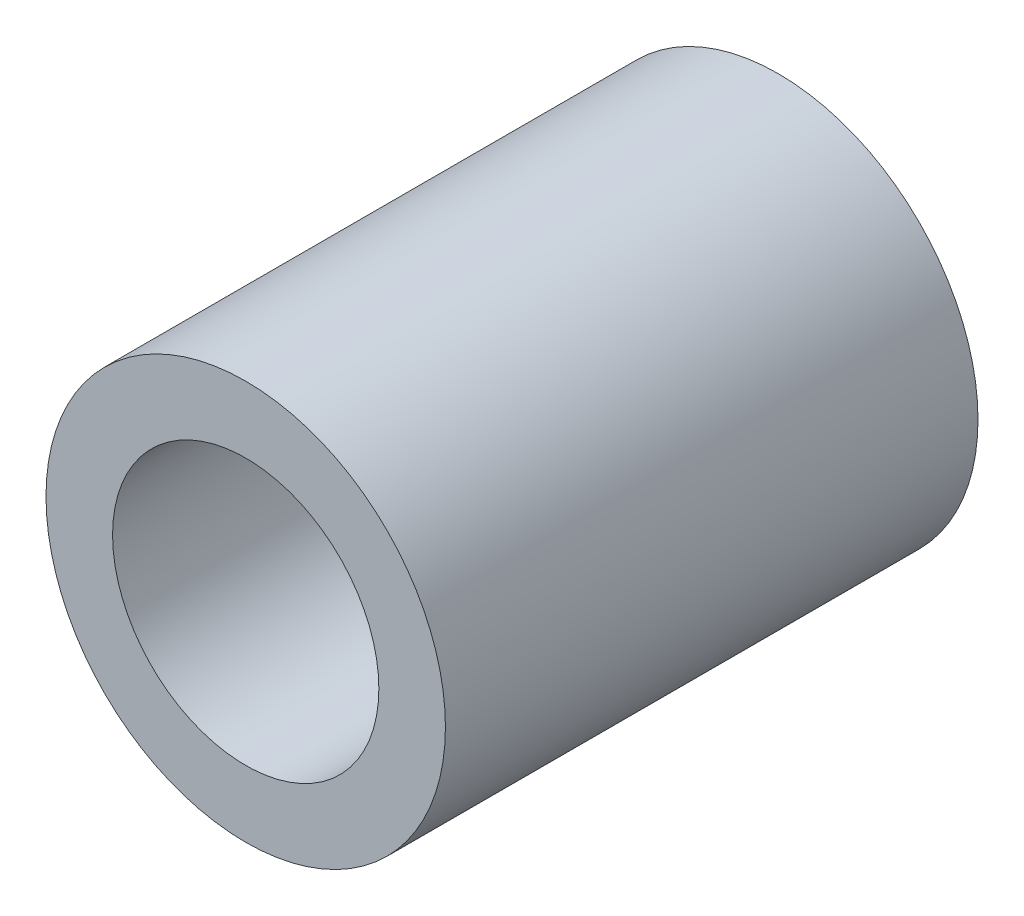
ISO-10303-21;
HEADER;
FILE_DESCRIPTION(('STEP AP214'),'2;1');
FILE_NAME('part.step','',(''),(''),'','','');
FILE_SCHEMA(('AUTOMOTIVE_DESIGN { 1 0 10303 214 1 1 1 1 }'));
ENDSEC;
DATA;
#1=APPLICATION_CONTEXT('core data for automotive mechanical design processes');
#2=APPLICATION_PROTOCOL_DEFINITION('international standard','automotive_design',2000,#1);
#3=PRODUCT_CONTEXT('',#1,'mechanical');
#4=PRODUCT('Part','Part','',(#3));
#5=PRODUCT_RELATED_PRODUCT_CATEGORY('part','',(#4));
#6=PRODUCT_DEFINITION_FORMATION('','',#4);
#7=PRODUCT_DEFINITION_CONTEXT('part definition',#1,'design');
#8=PRODUCT_DEFINITION('design','',#6,#7);
#9=PRODUCT_DEFINITION_SHAPE('','',#8);
#10=(LENGTH_UNIT() NAMED_UNIT(*) SI_UNIT(.MILLI.,.METRE.));
#11=(NAMED_UNIT(*) PLANE_ANGLE_UNIT() SI_UNIT($,.RADIAN.));
#12=(NAMED_UNIT(*) SI_UNIT($,.STERADIAN.) SOLID_ANGLE_UNIT());
#13=UNCERTAINTY_MEASURE_WITH_UNIT(LENGTH_MEASURE(1.E-05),#10,'distance_accuracy_value','');
#14=(GEOMETRIC_REPRESENTATION_CONTEXT(3) GLOBAL_UNCERTAINTY_ASSIGNED_CONTEXT((#13)) GLOBAL_UNIT_ASSIGNED_CONTEXT((#10,
#11,#12)) REPRESENTATION_CONTEXT('',''));
#15=CARTESIAN_POINT('',(0.,0.,0.));
#16=DIRECTION('',(0.,0.,1.));
#17=DIRECTION('',(1.,0.,0.));
#18=AXIS2_PLACEMENT_3D('',#15,#16,#17);
#19=CARTESIAN_POINT('',(0.,0.,32.));
#20=DIRECTION('',(0.,0.,1.));
#21=DIRECTION('',(1.,0.,0.));
#22=AXIS2_PLACEMENT_3D('',#19,#20,#21);
#23=PLANE('',#22);
#24=CARTESIAN_POINT('',(0.,0.,32.));
#25=DIRECTION('',(0.,0.,1.));
#26=DIRECTION('',(1.,0.,0.));
#27=AXIS2_PLACEMENT_3D('',#24,#25,#26);
#28=CIRCLE('',#27,12.);
#29=CARTESIAN_POINT('',(12.,0.,32.));
#30=VERTEX_POINT('',#29);
#31=EDGE_CURVE('E10',#30,#30,#28,.T.);
#32=ORIENTED_EDGE('',*,*,#31,.T.);
#33=EDGE_LOOP('',(#32));
#34=FACE_BOUND('',#33,.T.);
#35=CARTESIAN_POINT('',(0.,0.,32.));
#36=DIRECTION('',(0.,0.,1.));
#37=DIRECTION('',(1.,0.,0.));
#38=AXIS2_PLACEMENT_3D('',#35,#36,#37);
#39=CIRCLE('',#38,8.);
#40=CARTESIAN_POINT('',(8.,0.,32.));
#41=VERTEX_POINT('',#40);
#42=EDGE_CURVE('E43',#41,#41,#39,.T.);
#43=ORIENTED_EDGE('',*,*,#42,.F.);
#44=EDGE_LOOP('',(#43));
#45=FACE_BOUND('',#44,.T.);
#46=ADVANCED_FACE('F32',(#34,#45),#23,.T.);
#47=CARTESIAN_POINT('',(0.,0.,0.));
#48=DIRECTION('',(0.,0.,1.));
#49=DIRECTION('',(1.,0.,0.));
#50=AXIS2_PLACEMENT_3D('',#47,#48,#49);
#51=PLANE('',#50);
#52=CARTESIAN_POINT('',(0.,0.,0.));
#53=DIRECTION('',(0.,0.,1.));
#54=DIRECTION('',(1.,0.,0.));
#55=AXIS2_PLACEMENT_3D('',#52,#53,#54);
#56=CIRCLE('',#55,12.);
#57=CARTESIAN_POINT('',(12.,0.,0.));
#58=VERTEX_POINT('',#57);
#59=EDGE_CURVE('E39',#58,#58,#56,.T.);
#60=ORIENTED_EDGE('',*,*,#59,.F.);
#61=EDGE_LOOP('',(#60));
#62=FACE_BOUND('',#61,.T.);
#63=CARTESIAN_POINT('',(0.,0.,0.));
#64=DIRECTION('',(0.,0.,1.));
#65=DIRECTION('',(1.,0.,0.));
#66=AXIS2_PLACEMENT_3D('',#63,#64,#65);
#67=CIRCLE('',#66,8.);
#68=CARTESIAN_POINT('',(8.,0.,0.));
#69=VERTEX_POINT('',#68);
#70=EDGE_CURVE('E47',#69,#69,#67,.T.);
#71=ORIENTED_EDGE('',*,*,#70,.T.);
#72=EDGE_LOOP('',(#71));
#73=FACE_BOUND('',#72,.T.);
#74=ADVANCED_FACE('F53',(#62,#73),#51,.F.);
#75=CARTESIAN_POINT('',(0.,0.,32.));
#76=DIRECTION('',(0.,0.,-1.));
#77=DIRECTION('',(-1.,0.,0.));
#78=AXIS2_PLACEMENT_3D('',#75,#76,#77);
#79=CYLINDRICAL_SURFACE('',#78,12.);
#80=ORIENTED_EDGE('',*,*,#31,.F.);
#81=EDGE_LOOP('',(#80));
#82=FACE_BOUND('',#81,.T.);
#83=ORIENTED_EDGE('',*,*,#59,.T.);
#84=EDGE_LOOP('',(#83));
#85=FACE_BOUND('',#84,.T.);
#86=ADVANCED_FACE('F34',(#82,#85),#79,.T.);
#87=CARTESIAN_POINT('',(0.,0.,32.));
#88=DIRECTION('',(0.,0.,-1.));
#89=DIRECTION('',(-1.,0.,0.));
#90=AXIS2_PLACEMENT_3D('',#87,#88,#89);
#91=CYLINDRICAL_SURFACE('',#90,8.);
#92=ORIENTED_EDGE('',*,*,#42,.T.);
#93=EDGE_LOOP('',(#92));
#94=FACE_BOUND('',#93,.T.);
#95=ORIENTED_EDGE('',*,*,#70,.F.);
#96=EDGE_LOOP('',(#95));
#97=FACE_BOUND('',#96,.T.);
#98=ADVANCED_FACE('F55',(#94,#97),#91,.F.);
#99=CLOSED_SHELL('',(#46,#74,#86,#98));
#100=MANIFOLD_SOLID_BREP('B2',#99);
#101=ADVANCED_BREP_SHAPE_REPRESENTATION('',(#18,#100),#14);
#102=SHAPE_DEFINITION_REPRESENTATION(#9,#101);
ENDSEC;
END-ISO-10303-21;
